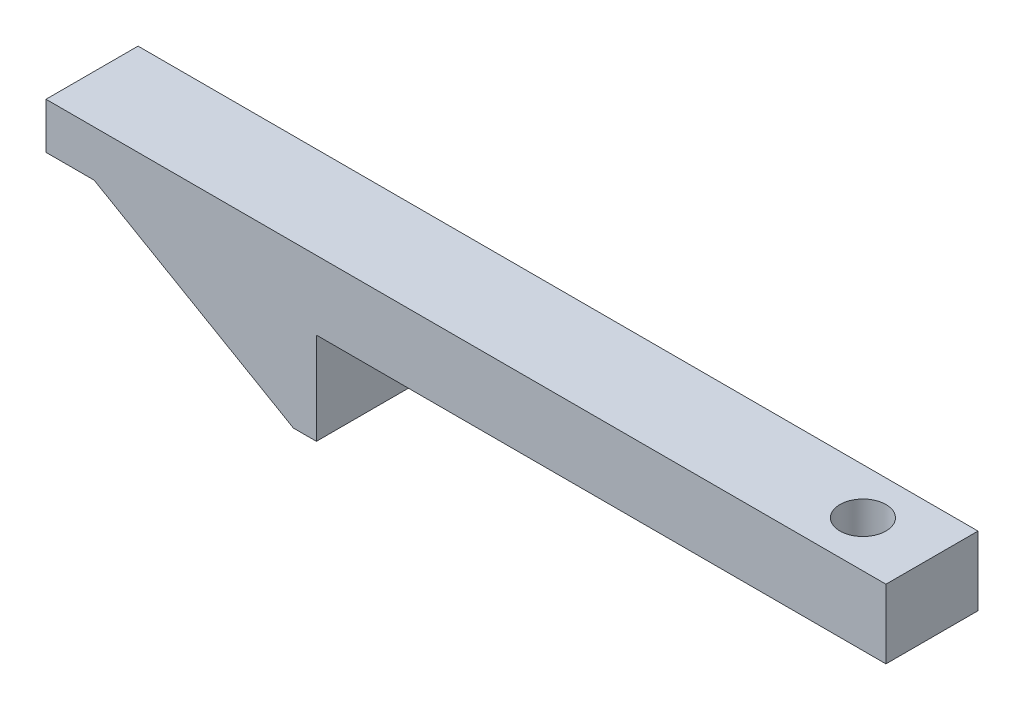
from build123d import *

# Parameters (mm, degrees)
BOSS_EXTRUDE1_DEPTH             = 6.35
F_1_4_0_25_DIAMETER_HOLE1_D     = 6.35
F_1_4_0_25_DIAMETER_HOLE1_DEPTH = 22.225
F_1_4_0_25_DIAMETER_HOLE1_TIP   = 1.907732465


with BuildPart() as part:
    # Sketch2 → Boss-Extrude1 (new, symmetric)
    with BuildSketch(Plane.XY):
        Polygon((-72.2376, -22.225), (-99.73390657, -6.35), (-106.3752, -6.35), (-106.3752, 0), (0, 0), (9.525, 0), (9.525, -9.525), (-69.0626, -9.525), (-69.0626, -22.225), align=None)
    extrude(amount=BOSS_EXTRUDE1_DEPTH, both=True)

    # 1_4 _0.25_ Diameter Hole1
    with Locations(Plane(origin=(0, -9.525, 0), x_dir=(-1, 0, 0), z_dir=(0, -1, 0))):
        with Locations((0, 0)):
            Hole(F_1_4_0_25_DIAMETER_HOLE1_D / 2, depth=F_1_4_0_25_DIAMETER_HOLE1_DEPTH)
            with Locations((0, 0, -(F_1_4_0_25_DIAMETER_HOLE1_DEPTH + F_1_4_0_25_DIAMETER_HOLE1_TIP / 2))):  # 118° drill point
                Cone(0, F_1_4_0_25_DIAMETER_HOLE1_D / 2, F_1_4_0_25_DIAMETER_HOLE1_TIP, mode=Mode.SUBTRACT)


solid = part.part
